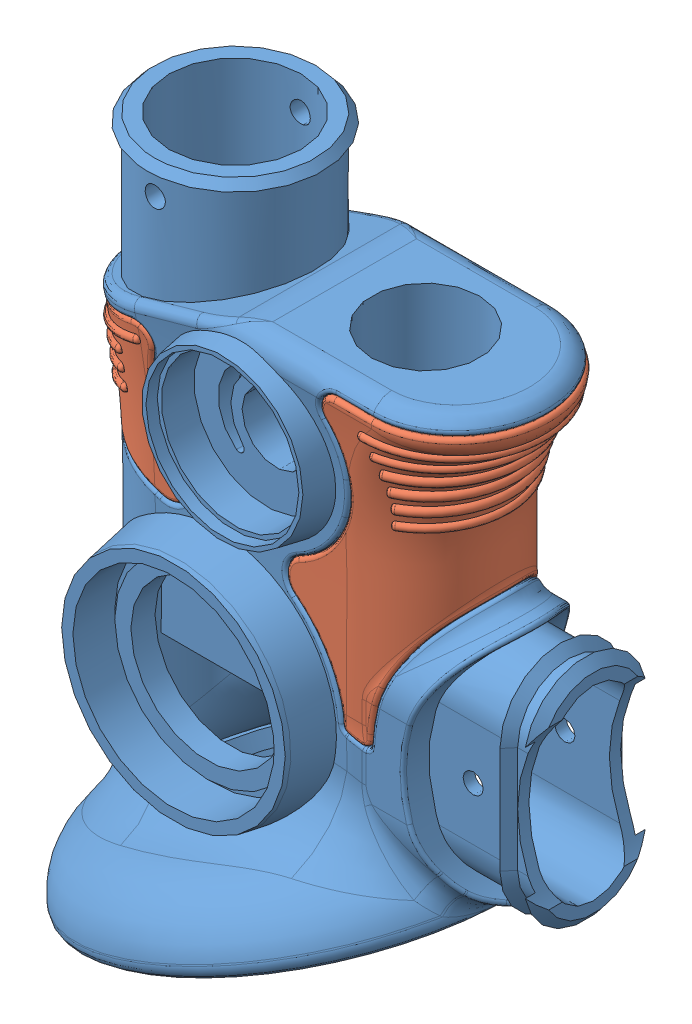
SolidWorks assembly RegulatorBody.SLDASM, configuration Default (file format 3100). Lengths in mm.
Overall size (73.37 104.55 63.08).
2 component instances, 2 part files, 6 mates.
Components (placement in the parent):
- RegulatorBody-1: RegulatorBody.SLDPRT [Default] at origin size (73.37 104.55 63.08)
- Overmold-1: Overmold.SLDPRT [Full] at origin size (70.51 47.83 36.83)
Mates (geometry in assembly coordinates):
- MateCoincident1: coincident aligned: plane of RegulatorBody-1; plane of assembly
- MateCoincident2: coincident aligned: plane of RegulatorBody-1; plane of assembly
- MateCoincident3: coincident aligned: plane of RegulatorBody-1; plane of assembly
- MateCoincident4: coincident aligned: plane of Overmold-1; plane of assembly
- MateCoincident5: coincident aligned: plane of Overmold-1; plane of assembly
- MateCoincident6: coincident aligned: plane of Overmold-1; plane of assembly
